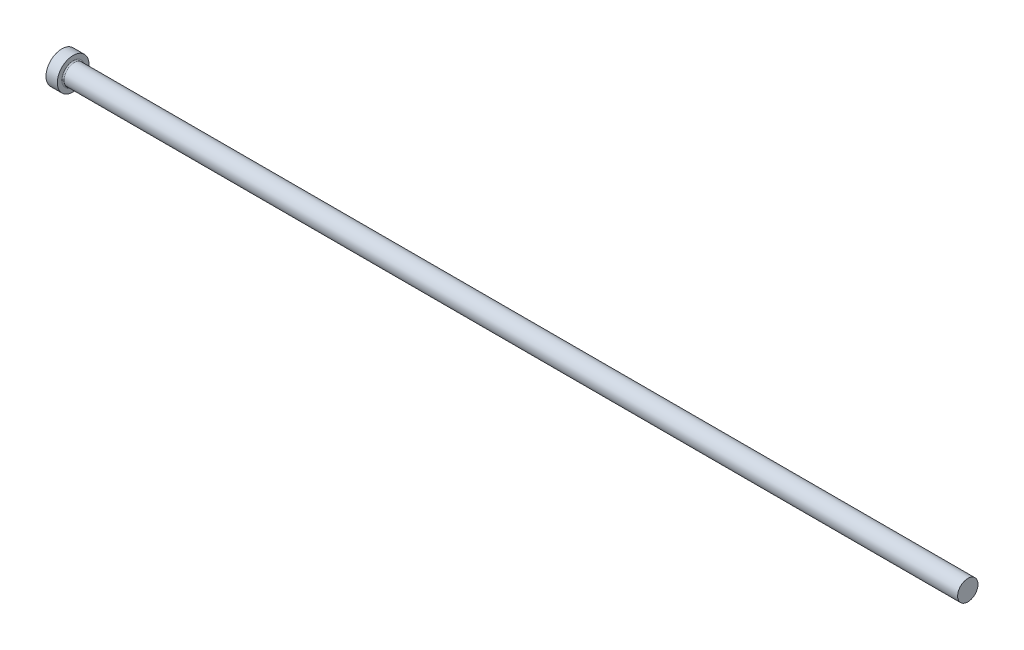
ISO-10303-21;
HEADER;
FILE_DESCRIPTION(('STEP AP214'),'2;1');
FILE_NAME('part.step','',(''),(''),'','','');
FILE_SCHEMA(('AUTOMOTIVE_DESIGN { 1 0 10303 214 1 1 1 1 }'));
ENDSEC;
DATA;
#1=APPLICATION_CONTEXT('core data for automotive mechanical design processes');
#2=APPLICATION_PROTOCOL_DEFINITION('international standard','automotive_design',2000,#1);
#3=PRODUCT_CONTEXT('',#1,'mechanical');
#4=PRODUCT('Part','Part','',(#3));
#5=PRODUCT_RELATED_PRODUCT_CATEGORY('part','',(#4));
#6=PRODUCT_DEFINITION_FORMATION('','',#4);
#7=PRODUCT_DEFINITION_CONTEXT('part definition',#1,'design');
#8=PRODUCT_DEFINITION('design','',#6,#7);
#9=PRODUCT_DEFINITION_SHAPE('','',#8);
#10=(LENGTH_UNIT() NAMED_UNIT(*) SI_UNIT(.MILLI.,.METRE.));
#11=(NAMED_UNIT(*) PLANE_ANGLE_UNIT() SI_UNIT($,.RADIAN.));
#12=(NAMED_UNIT(*) SI_UNIT($,.STERADIAN.) SOLID_ANGLE_UNIT());
#13=UNCERTAINTY_MEASURE_WITH_UNIT(LENGTH_MEASURE(1.E-05),#10,'distance_accuracy_value','');
#14=(GEOMETRIC_REPRESENTATION_CONTEXT(3) GLOBAL_UNCERTAINTY_ASSIGNED_CONTEXT((#13)) GLOBAL_UNIT_ASSIGNED_CONTEXT((#10,
#11,#12)) REPRESENTATION_CONTEXT('',''));
#15=CARTESIAN_POINT('',(0.,0.,0.));
#16=DIRECTION('',(0.,0.,1.));
#17=DIRECTION('',(1.,0.,0.));
#18=AXIS2_PLACEMENT_3D('',#15,#16,#17);
#19=CARTESIAN_POINT('',(0.,0.,0.));
#20=DIRECTION('',(-1.,0.,0.));
#21=DIRECTION('',(0.,-1.,0.));
#22=AXIS2_PLACEMENT_3D('',#19,#20,#21);
#23=PLANE('',#22);
#24=CARTESIAN_POINT('',(0.,0.,0.));
#25=DIRECTION('',(1.,0.,0.));
#26=DIRECTION('',(0.,1.,0.));
#27=AXIS2_PLACEMENT_3D('',#24,#25,#26);
#28=CIRCLE('',#27,7.);
#29=CARTESIAN_POINT('',(0.,7.,0.));
#30=VERTEX_POINT('',#29);
#31=EDGE_CURVE('E25',#30,#30,#28,.T.);
#32=ORIENTED_EDGE('',*,*,#31,.F.);
#33=EDGE_LOOP('',(#32));
#34=FACE_BOUND('',#33,.T.);
#35=ADVANCED_FACE('F14',(#34),#23,.T.);
#36=CARTESIAN_POINT('',(400.,0.,0.));
#37=DIRECTION('',(1.,0.,0.));
#38=DIRECTION('',(0.,1.,0.));
#39=AXIS2_PLACEMENT_3D('',#36,#37,#38);
#40=CYLINDRICAL_SURFACE('',#39,7.);
#41=ORIENTED_EDGE('',*,*,#31,.T.);
#42=EDGE_LOOP('',(#41));
#43=FACE_BOUND('',#42,.T.);
#44=CARTESIAN_POINT('',(5.,0.,0.));
#45=DIRECTION('',(1.,0.,0.));
#46=DIRECTION('',(0.,1.,0.));
#47=AXIS2_PLACEMENT_3D('',#44,#45,#46);
#48=CIRCLE('',#47,7.);
#49=CARTESIAN_POINT('',(5.,7.,0.));
#50=VERTEX_POINT('',#49);
#51=EDGE_CURVE('E29',#50,#50,#48,.T.);
#52=ORIENTED_EDGE('',*,*,#51,.F.);
#53=EDGE_LOOP('',(#52));
#54=FACE_BOUND('',#53,.T.);
#55=ADVANCED_FACE('F51',(#43,#54),#40,.T.);
#56=CARTESIAN_POINT('',(5.,7.,0.));
#57=DIRECTION('',(1.,0.,0.));
#58=DIRECTION('',(0.,1.,0.));
#59=AXIS2_PLACEMENT_3D('',#56,#57,#58);
#60=PLANE('',#59);
#61=CARTESIAN_POINT('',(5.,0.,0.));
#62=DIRECTION('',(1.,0.,0.));
#63=DIRECTION('',(0.,1.,0.));
#64=AXIS2_PLACEMENT_3D('',#61,#62,#63);
#65=CIRCLE('',#64,4.99999999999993);
#66=CARTESIAN_POINT('',(5.,4.99999999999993,0.));
#67=VERTEX_POINT('',#66);
#68=EDGE_CURVE('E9',#67,#67,#65,.F.);
#69=ORIENTED_EDGE('',*,*,#68,.T.);
#70=EDGE_LOOP('',(#69));
#71=FACE_BOUND('',#70,.T.);
#72=ORIENTED_EDGE('',*,*,#51,.T.);
#73=EDGE_LOOP('',(#72));
#74=FACE_BOUND('',#73,.T.);
#75=ADVANCED_FACE('F42',(#71,#74),#60,.T.);
#76=CARTESIAN_POINT('',(400.,0.,0.));
#77=DIRECTION('',(1.,0.,0.));
#78=DIRECTION('',(0.,1.,0.));
#79=AXIS2_PLACEMENT_3D('',#76,#77,#78);
#80=CYLINDRICAL_SURFACE('',#79,4.49999999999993);
#81=CARTESIAN_POINT('',(5.5,0.,0.));
#82=DIRECTION('',(1.,0.,0.));
#83=DIRECTION('',(0.,1.,0.));
#84=AXIS2_PLACEMENT_3D('',#81,#82,#83);
#85=CIRCLE('',#84,4.49999999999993);
#86=CARTESIAN_POINT('',(5.5,4.49999999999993,0.));
#87=VERTEX_POINT('',#86);
#88=EDGE_CURVE('E21',#87,#87,#85,.T.);
#89=ORIENTED_EDGE('',*,*,#88,.T.);
#90=EDGE_LOOP('',(#89));
#91=FACE_BOUND('',#90,.T.);
#92=CARTESIAN_POINT('',(400.,0.,0.));
#93=DIRECTION('',(1.,0.,0.));
#94=DIRECTION('',(0.,1.,0.));
#95=AXIS2_PLACEMENT_3D('',#92,#93,#94);
#96=CIRCLE('',#95,4.49999999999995);
#97=CARTESIAN_POINT('',(400.,4.49999999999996,0.));
#98=VERTEX_POINT('',#97);
#99=EDGE_CURVE('E34',#98,#98,#96,.T.);
#100=ORIENTED_EDGE('',*,*,#99,.F.);
#101=EDGE_LOOP('',(#100));
#102=FACE_BOUND('',#101,.T.);
#103=ADVANCED_FACE('F40',(#91,#102),#80,.T.);
#104=CARTESIAN_POINT('',(400.,4.5,0.));
#105=DIRECTION('',(1.,0.,0.));
#106=DIRECTION('',(0.,1.,0.));
#107=AXIS2_PLACEMENT_3D('',#104,#105,#106);
#108=PLANE('',#107);
#109=ORIENTED_EDGE('',*,*,#99,.T.);
#110=EDGE_LOOP('',(#109));
#111=FACE_BOUND('',#110,.T.);
#112=ADVANCED_FACE('F38',(#111),#108,.T.);
#113=CARTESIAN_POINT('',(5.5,0.,0.));
#114=DIRECTION('',(1.,0.,0.));
#115=DIRECTION('',(0.,1.,0.));
#116=AXIS2_PLACEMENT_3D('',#113,#114,#115);
#117=TOROIDAL_SURFACE('',#116,4.99999999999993,0.5);
#118=ORIENTED_EDGE('',*,*,#68,.F.);
#119=EDGE_LOOP('',(#118));
#120=FACE_BOUND('',#119,.T.);
#121=ORIENTED_EDGE('',*,*,#88,.F.);
#122=EDGE_LOOP('',(#121));
#123=FACE_BOUND('',#122,.T.);
#124=ADVANCED_FACE('F16',(#120,#123),#117,.F.);
#125=CLOSED_SHELL('',(#35,#55,#75,#103,#112,#124));
#126=MANIFOLD_SOLID_BREP('B1',#125);
#127=ADVANCED_BREP_SHAPE_REPRESENTATION('',(#18,#126),#14);
#128=SHAPE_DEFINITION_REPRESENTATION(#9,#127);
ENDSEC;
END-ISO-10303-21;
